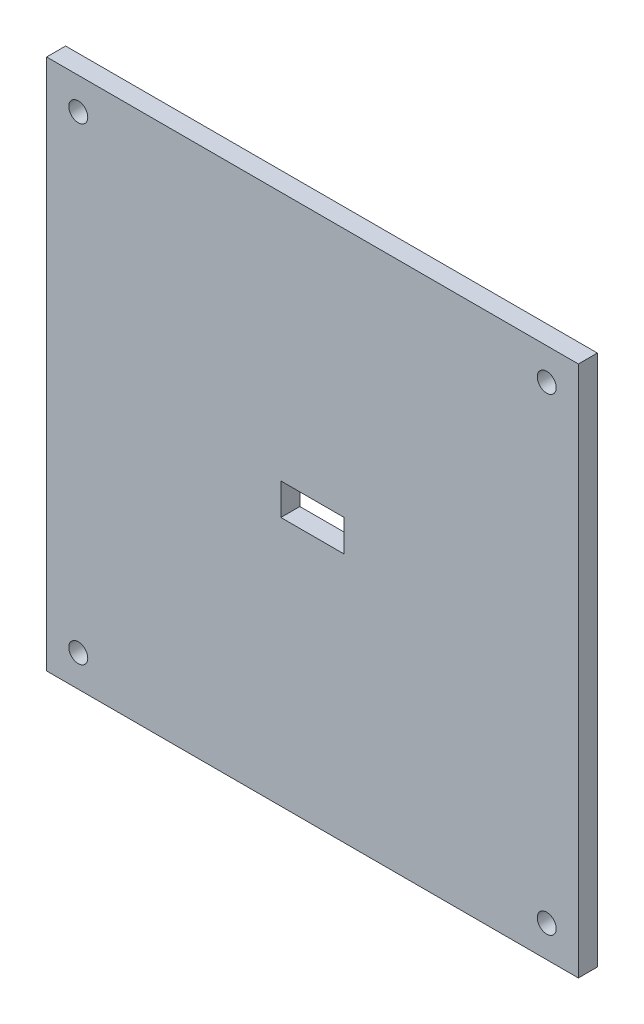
ISO-10303-21;
HEADER;
FILE_DESCRIPTION(('STEP AP214'),'2;1');
FILE_NAME('part.step','',(''),(''),'','','');
FILE_SCHEMA(('AUTOMOTIVE_DESIGN { 1 0 10303 214 1 1 1 1 }'));
ENDSEC;
DATA;
#1=APPLICATION_CONTEXT('core data for automotive mechanical design processes');
#2=APPLICATION_PROTOCOL_DEFINITION('international standard','automotive_design',2000,#1);
#3=PRODUCT_CONTEXT('',#1,'mechanical');
#4=PRODUCT('Part','Part','',(#3));
#5=PRODUCT_RELATED_PRODUCT_CATEGORY('part','',(#4));
#6=PRODUCT_DEFINITION_FORMATION('','',#4);
#7=PRODUCT_DEFINITION_CONTEXT('part definition',#1,'design');
#8=PRODUCT_DEFINITION('design','',#6,#7);
#9=PRODUCT_DEFINITION_SHAPE('','',#8);
#10=(LENGTH_UNIT() NAMED_UNIT(*) SI_UNIT(.MILLI.,.METRE.));
#11=(NAMED_UNIT(*) PLANE_ANGLE_UNIT() SI_UNIT($,.RADIAN.));
#12=(NAMED_UNIT(*) SI_UNIT($,.STERADIAN.) SOLID_ANGLE_UNIT());
#13=UNCERTAINTY_MEASURE_WITH_UNIT(LENGTH_MEASURE(1.E-05),#10,'distance_accuracy_value','');
#14=(GEOMETRIC_REPRESENTATION_CONTEXT(3) GLOBAL_UNCERTAINTY_ASSIGNED_CONTEXT((#13)) GLOBAL_UNIT_ASSIGNED_CONTEXT((#10,
#11,#12)) REPRESENTATION_CONTEXT('',''));
#15=CARTESIAN_POINT('',(0.,0.,0.));
#16=DIRECTION('',(0.,0.,1.));
#17=DIRECTION('',(1.,0.,0.));
#18=AXIS2_PLACEMENT_3D('',#15,#16,#17);
#19=CARTESIAN_POINT('',(0.,0.,3.));
#20=DIRECTION('',(0.,0.,1.));
#21=DIRECTION('',(1.,0.,0.));
#22=AXIS2_PLACEMENT_3D('',#19,#20,#21);
#23=PLANE('',#22);
#24=CARTESIAN_POINT('',(37.0000000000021,-36.9999999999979,3.));
#25=DIRECTION('',(0.,0.,1.));
#26=DIRECTION('',(1.,0.,0.));
#27=AXIS2_PLACEMENT_3D('',#24,#25,#26);
#28=CIRCLE('',#27,1.50000000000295);
#29=CARTESIAN_POINT('',(38.500000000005,-36.9999999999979,3.));
#30=VERTEX_POINT('',#29);
#31=EDGE_CURVE('E245',#30,#30,#28,.T.);
#32=ORIENTED_EDGE('',*,*,#31,.F.);
#33=EDGE_LOOP('',(#32));
#34=FACE_BOUND('',#33,.T.);
#35=CARTESIAN_POINT('',(-37.,37.,3.));
#36=DIRECTION('',(0.,0.,1.));
#37=DIRECTION('',(1.,0.,0.));
#38=AXIS2_PLACEMENT_3D('',#35,#36,#37);
#39=CIRCLE('',#38,1.5);
#40=CARTESIAN_POINT('',(-35.5,37.,3.));
#41=VERTEX_POINT('',#40);
#42=EDGE_CURVE('E127',#41,#41,#39,.T.);
#43=ORIENTED_EDGE('',*,*,#42,.F.);
#44=EDGE_LOOP('',(#43));
#45=FACE_BOUND('',#44,.T.);
#46=DIRECTION('',(0.,1.,0.));
#47=VECTOR('',#46,1.);
#48=CARTESIAN_POINT('',(42.,42.,3.));
#49=LINE('',#48,#47);
#50=CARTESIAN_POINT('',(42.,-42.,3.));
#51=VERTEX_POINT('',#50);
#52=CARTESIAN_POINT('',(42.,42.,3.));
#53=VERTEX_POINT('',#52);
#54=EDGE_CURVE('E137',#51,#53,#49,.T.);
#55=ORIENTED_EDGE('',*,*,#54,.T.);
#56=DIRECTION('',(-1.,0.,0.));
#57=VECTOR('',#56,1.);
#58=CARTESIAN_POINT('',(-42.,42.,3.));
#59=LINE('',#58,#57);
#60=CARTESIAN_POINT('',(-42.,42.,3.));
#61=VERTEX_POINT('',#60);
#62=EDGE_CURVE('E140',#53,#61,#59,.T.);
#63=ORIENTED_EDGE('',*,*,#62,.T.);
#64=DIRECTION('',(0.,-1.,0.));
#65=VECTOR('',#64,1.);
#66=CARTESIAN_POINT('',(-42.,42.,3.));
#67=LINE('',#66,#65);
#68=CARTESIAN_POINT('',(-42.,-42.,3.));
#69=VERTEX_POINT('',#68);
#70=EDGE_CURVE('E143',#61,#69,#67,.T.);
#71=ORIENTED_EDGE('',*,*,#70,.T.);
#72=DIRECTION('',(1.,0.,0.));
#73=VECTOR('',#72,1.);
#74=CARTESIAN_POINT('',(-42.,-42.,3.));
#75=LINE('',#74,#73);
#76=EDGE_CURVE('E145',#69,#51,#75,.T.);
#77=ORIENTED_EDGE('',*,*,#76,.T.);
#78=EDGE_LOOP('',(#55,#63,#71,#77));
#79=FACE_BOUND('',#78,.T.);
#80=DIRECTION('',(-1.,0.,0.));
#81=VECTOR('',#80,1.);
#82=CARTESIAN_POINT('',(-5.,2.50000000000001,3.));
#83=LINE('',#82,#81);
#84=CARTESIAN_POINT('',(5.,2.50000000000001,3.));
#85=VERTEX_POINT('',#84);
#86=CARTESIAN_POINT('',(-5.,2.50000000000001,3.));
#87=VERTEX_POINT('',#86);
#88=EDGE_CURVE('E106',#85,#87,#83,.T.);
#89=ORIENTED_EDGE('',*,*,#88,.F.);
#90=DIRECTION('',(0.,1.,0.));
#91=VECTOR('',#90,1.);
#92=CARTESIAN_POINT('',(5.,2.50000000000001,3.));
#93=LINE('',#92,#91);
#94=CARTESIAN_POINT('',(5.,-2.49999999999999,3.));
#95=VERTEX_POINT('',#94);
#96=EDGE_CURVE('E98',#95,#85,#93,.T.);
#97=ORIENTED_EDGE('',*,*,#96,.F.);
#98=DIRECTION('',(1.,0.,0.));
#99=VECTOR('',#98,1.);
#100=CARTESIAN_POINT('',(-5.,-2.49999999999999,3.));
#101=LINE('',#100,#99);
#102=CARTESIAN_POINT('',(-5.,-2.49999999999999,3.));
#103=VERTEX_POINT('',#102);
#104=EDGE_CURVE('E121',#103,#95,#101,.T.);
#105=ORIENTED_EDGE('',*,*,#104,.F.);
#106=DIRECTION('',(0.,-1.,0.));
#107=VECTOR('',#106,1.);
#108=CARTESIAN_POINT('',(-5.,2.50000000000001,3.));
#109=LINE('',#108,#107);
#110=EDGE_CURVE('E119',#87,#103,#109,.T.);
#111=ORIENTED_EDGE('',*,*,#110,.F.);
#112=EDGE_LOOP('',(#89,#97,#105,#111));
#113=FACE_BOUND('',#112,.T.);
#114=CARTESIAN_POINT('',(37.,37.0000000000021,3.));
#115=DIRECTION('',(0.,0.,1.));
#116=DIRECTION('',(1.,0.,0.));
#117=AXIS2_PLACEMENT_3D('',#114,#115,#116);
#118=CIRCLE('',#117,1.50000000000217);
#119=CARTESIAN_POINT('',(38.5000000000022,37.0000000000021,3.));
#120=VERTEX_POINT('',#119);
#121=EDGE_CURVE('E251',#120,#120,#118,.T.);
#122=ORIENTED_EDGE('',*,*,#121,.F.);
#123=EDGE_LOOP('',(#122));
#124=FACE_BOUND('',#123,.T.);
#125=CARTESIAN_POINT('',(-36.9999999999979,-37.,3.));
#126=DIRECTION('',(0.,0.,1.));
#127=DIRECTION('',(1.,0.,0.));
#128=AXIS2_PLACEMENT_3D('',#125,#126,#127);
#129=CIRCLE('',#128,1.5000000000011);
#130=CARTESIAN_POINT('',(-35.4999999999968,-37.,3.));
#131=VERTEX_POINT('',#130);
#132=EDGE_CURVE('E236',#131,#131,#129,.T.);
#133=ORIENTED_EDGE('',*,*,#132,.F.);
#134=EDGE_LOOP('',(#133));
#135=FACE_BOUND('',#134,.T.);
#136=ADVANCED_FACE('F33',(#34,#45,#79,#113,#124,#135),#23,.T.);
#137=CARTESIAN_POINT('',(0.,0.,0.));
#138=DIRECTION('',(0.,0.,1.));
#139=DIRECTION('',(1.,0.,0.));
#140=AXIS2_PLACEMENT_3D('',#137,#138,#139);
#141=PLANE('',#140);
#142=DIRECTION('',(0.,1.,0.));
#143=VECTOR('',#142,1.);
#144=CARTESIAN_POINT('',(42.,42.,0.));
#145=LINE('',#144,#143);
#146=CARTESIAN_POINT('',(42.,-42.,0.));
#147=VERTEX_POINT('',#146);
#148=CARTESIAN_POINT('',(42.,42.,0.));
#149=VERTEX_POINT('',#148);
#150=EDGE_CURVE('E114',#147,#149,#145,.T.);
#151=ORIENTED_EDGE('',*,*,#150,.F.);
#152=DIRECTION('',(1.,0.,0.));
#153=VECTOR('',#152,1.);
#154=CARTESIAN_POINT('',(-42.,-42.,0.));
#155=LINE('',#154,#153);
#156=CARTESIAN_POINT('',(-42.,-42.,0.));
#157=VERTEX_POINT('',#156);
#158=EDGE_CURVE('E141',#157,#147,#155,.T.);
#159=ORIENTED_EDGE('',*,*,#158,.F.);
#160=DIRECTION('',(0.,-1.,0.));
#161=VECTOR('',#160,1.);
#162=CARTESIAN_POINT('',(-42.,42.,0.));
#163=LINE('',#162,#161);
#164=CARTESIAN_POINT('',(-42.,42.,0.));
#165=VERTEX_POINT('',#164);
#166=EDGE_CURVE('E152',#165,#157,#163,.T.);
#167=ORIENTED_EDGE('',*,*,#166,.F.);
#168=DIRECTION('',(-1.,0.,0.));
#169=VECTOR('',#168,1.);
#170=CARTESIAN_POINT('',(-42.,42.,0.));
#171=LINE('',#170,#169);
#172=EDGE_CURVE('E150',#149,#165,#171,.T.);
#173=ORIENTED_EDGE('',*,*,#172,.F.);
#174=EDGE_LOOP('',(#151,#159,#167,#173));
#175=FACE_BOUND('',#174,.T.);
#176=DIRECTION('',(0.,1.,0.));
#177=VECTOR('',#176,1.);
#178=CARTESIAN_POINT('',(5.,2.50000000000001,0.));
#179=LINE('',#178,#177);
#180=CARTESIAN_POINT('',(5.,-2.49999999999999,0.));
#181=VERTEX_POINT('',#180);
#182=CARTESIAN_POINT('',(5.,2.50000000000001,0.));
#183=VERTEX_POINT('',#182);
#184=EDGE_CURVE('E56',#181,#183,#179,.T.);
#185=ORIENTED_EDGE('',*,*,#184,.T.);
#186=DIRECTION('',(-1.,0.,0.));
#187=VECTOR('',#186,1.);
#188=CARTESIAN_POINT('',(-5.,2.50000000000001,0.));
#189=LINE('',#188,#187);
#190=CARTESIAN_POINT('',(-5.,2.50000000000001,0.));
#191=VERTEX_POINT('',#190);
#192=EDGE_CURVE('E113',#183,#191,#189,.T.);
#193=ORIENTED_EDGE('',*,*,#192,.T.);
#194=DIRECTION('',(0.,-1.,0.));
#195=VECTOR('',#194,1.);
#196=CARTESIAN_POINT('',(-5.,2.50000000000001,0.));
#197=LINE('',#196,#195);
#198=CARTESIAN_POINT('',(-5.,-2.49999999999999,0.));
#199=VERTEX_POINT('',#198);
#200=EDGE_CURVE('E129',#191,#199,#197,.T.);
#201=ORIENTED_EDGE('',*,*,#200,.T.);
#202=DIRECTION('',(1.,0.,0.));
#203=VECTOR('',#202,1.);
#204=CARTESIAN_POINT('',(-5.,-2.49999999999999,0.));
#205=LINE('',#204,#203);
#206=EDGE_CURVE('E107',#199,#181,#205,.T.);
#207=ORIENTED_EDGE('',*,*,#206,.T.);
#208=EDGE_LOOP('',(#185,#193,#201,#207));
#209=FACE_BOUND('',#208,.T.);
#210=CARTESIAN_POINT('',(-37.,37.,0.));
#211=DIRECTION('',(0.,0.,1.));
#212=DIRECTION('',(1.,0.,0.));
#213=AXIS2_PLACEMENT_3D('',#210,#211,#212);
#214=CIRCLE('',#213,1.5);
#215=CARTESIAN_POINT('',(-35.5,37.,0.));
#216=VERTEX_POINT('',#215);
#217=EDGE_CURVE('E254',#216,#216,#214,.T.);
#218=ORIENTED_EDGE('',*,*,#217,.T.);
#219=EDGE_LOOP('',(#218));
#220=FACE_BOUND('',#219,.T.);
#221=CARTESIAN_POINT('',(37.,37.0000000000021,0.));
#222=DIRECTION('',(0.,0.,1.));
#223=DIRECTION('',(1.,0.,0.));
#224=AXIS2_PLACEMENT_3D('',#221,#222,#223);
#225=CIRCLE('',#224,1.50000000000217);
#226=CARTESIAN_POINT('',(38.5000000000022,37.0000000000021,0.));
#227=VERTEX_POINT('',#226);
#228=EDGE_CURVE('E248',#227,#227,#225,.T.);
#229=ORIENTED_EDGE('',*,*,#228,.T.);
#230=EDGE_LOOP('',(#229));
#231=FACE_BOUND('',#230,.T.);
#232=CARTESIAN_POINT('',(37.0000000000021,-36.9999999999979,0.));
#233=DIRECTION('',(0.,0.,1.));
#234=DIRECTION('',(1.,0.,0.));
#235=AXIS2_PLACEMENT_3D('',#232,#233,#234);
#236=CIRCLE('',#235,1.50000000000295);
#237=CARTESIAN_POINT('',(38.500000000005,-36.9999999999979,0.));
#238=VERTEX_POINT('',#237);
#239=EDGE_CURVE('E242',#238,#238,#236,.T.);
#240=ORIENTED_EDGE('',*,*,#239,.T.);
#241=EDGE_LOOP('',(#240));
#242=FACE_BOUND('',#241,.T.);
#243=CARTESIAN_POINT('',(-36.9999999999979,-37.,0.));
#244=DIRECTION('',(0.,0.,1.));
#245=DIRECTION('',(1.,0.,0.));
#246=AXIS2_PLACEMENT_3D('',#243,#244,#245);
#247=CIRCLE('',#246,1.5000000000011);
#248=CARTESIAN_POINT('',(-35.4999999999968,-37.,0.));
#249=VERTEX_POINT('',#248);
#250=EDGE_CURVE('E239',#249,#249,#247,.T.);
#251=ORIENTED_EDGE('',*,*,#250,.T.);
#252=EDGE_LOOP('',(#251));
#253=FACE_BOUND('',#252,.T.);
#254=ADVANCED_FACE('F170',(#175,#209,#220,#231,#242,#253),#141,.F.);
#255=CARTESIAN_POINT('',(42.,42.,3.));
#256=DIRECTION('',(-1.,0.,0.));
#257=DIRECTION('',(0.,-1.,0.));
#258=AXIS2_PLACEMENT_3D('',#255,#256,#257);
#259=PLANE('',#258);
#260=ORIENTED_EDGE('',*,*,#150,.T.);
#261=DIRECTION('',(0.,0.,-1.));
#262=VECTOR('',#261,1.);
#263=CARTESIAN_POINT('',(42.,42.,3.));
#264=LINE('',#263,#262);
#265=EDGE_CURVE('E11',#53,#149,#264,.T.);
#266=ORIENTED_EDGE('',*,*,#265,.F.);
#267=ORIENTED_EDGE('',*,*,#54,.F.);
#268=DIRECTION('',(0.,0.,-1.));
#269=VECTOR('',#268,1.);
#270=CARTESIAN_POINT('',(42.,-42.,3.));
#271=LINE('',#270,#269);
#272=EDGE_CURVE('E147',#51,#147,#271,.T.);
#273=ORIENTED_EDGE('',*,*,#272,.T.);
#274=EDGE_LOOP('',(#260,#266,#267,#273));
#275=FACE_BOUND('',#274,.T.);
#276=ADVANCED_FACE('F35',(#275),#259,.F.);
#277=CARTESIAN_POINT('',(-42.,42.,3.));
#278=DIRECTION('',(0.,-1.,0.));
#279=DIRECTION('',(0.,0.,-1.));
#280=AXIS2_PLACEMENT_3D('',#277,#278,#279);
#281=PLANE('',#280);
#282=ORIENTED_EDGE('',*,*,#172,.T.);
#283=DIRECTION('',(0.,0.,-1.));
#284=VECTOR('',#283,1.);
#285=CARTESIAN_POINT('',(-42.,42.,3.));
#286=LINE('',#285,#284);
#287=EDGE_CURVE('E41',#61,#165,#286,.T.);
#288=ORIENTED_EDGE('',*,*,#287,.F.);
#289=ORIENTED_EDGE('',*,*,#62,.F.);
#290=ORIENTED_EDGE('',*,*,#265,.T.);
#291=EDGE_LOOP('',(#282,#288,#289,#290));
#292=FACE_BOUND('',#291,.T.);
#293=ADVANCED_FACE('F180',(#292),#281,.F.);
#294=CARTESIAN_POINT('',(-42.,42.,3.));
#295=DIRECTION('',(1.,0.,0.));
#296=DIRECTION('',(0.,1.,0.));
#297=AXIS2_PLACEMENT_3D('',#294,#295,#296);
#298=PLANE('',#297);
#299=ORIENTED_EDGE('',*,*,#166,.T.);
#300=DIRECTION('',(0.,0.,-1.));
#301=VECTOR('',#300,1.);
#302=CARTESIAN_POINT('',(-42.,-42.,3.));
#303=LINE('',#302,#301);
#304=EDGE_CURVE('E157',#69,#157,#303,.T.);
#305=ORIENTED_EDGE('',*,*,#304,.F.);
#306=ORIENTED_EDGE('',*,*,#70,.F.);
#307=ORIENTED_EDGE('',*,*,#287,.T.);
#308=EDGE_LOOP('',(#299,#305,#306,#307));
#309=FACE_BOUND('',#308,.T.);
#310=ADVANCED_FACE('F164',(#309),#298,.F.);
#311=CARTESIAN_POINT('',(-42.,-42.,3.));
#312=DIRECTION('',(0.,1.,0.));
#313=DIRECTION('',(0.,0.,1.));
#314=AXIS2_PLACEMENT_3D('',#311,#312,#313);
#315=PLANE('',#314);
#316=ORIENTED_EDGE('',*,*,#158,.T.);
#317=ORIENTED_EDGE('',*,*,#272,.F.);
#318=ORIENTED_EDGE('',*,*,#76,.F.);
#319=ORIENTED_EDGE('',*,*,#304,.T.);
#320=EDGE_LOOP('',(#316,#317,#318,#319));
#321=FACE_BOUND('',#320,.T.);
#322=ADVANCED_FACE('F174',(#321),#315,.F.);
#323=CARTESIAN_POINT('',(5.,2.50000000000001,3.));
#324=DIRECTION('',(-1.,0.,0.));
#325=DIRECTION('',(0.,0.,1.));
#326=AXIS2_PLACEMENT_3D('',#323,#324,#325);
#327=PLANE('',#326);
#328=ORIENTED_EDGE('',*,*,#184,.F.);
#329=DIRECTION('',(0.,0.,-1.));
#330=VECTOR('',#329,1.);
#331=CARTESIAN_POINT('',(5.,-2.49999999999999,3.));
#332=LINE('',#331,#330);
#333=EDGE_CURVE('E102',#95,#181,#332,.T.);
#334=ORIENTED_EDGE('',*,*,#333,.F.);
#335=ORIENTED_EDGE('',*,*,#96,.T.);
#336=DIRECTION('',(0.,0.,-1.));
#337=VECTOR('',#336,1.);
#338=CARTESIAN_POINT('',(5.,2.50000000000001,3.));
#339=LINE('',#338,#337);
#340=EDGE_CURVE('E101',#85,#183,#339,.T.);
#341=ORIENTED_EDGE('',*,*,#340,.T.);
#342=EDGE_LOOP('',(#328,#334,#335,#341));
#343=FACE_BOUND('',#342,.T.);
#344=ADVANCED_FACE('F100',(#343),#327,.T.);
#345=CARTESIAN_POINT('',(-5.,2.50000000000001,3.));
#346=DIRECTION('',(0.,-1.,0.));
#347=DIRECTION('',(0.,0.,-1.));
#348=AXIS2_PLACEMENT_3D('',#345,#346,#347);
#349=PLANE('',#348);
#350=ORIENTED_EDGE('',*,*,#192,.F.);
#351=ORIENTED_EDGE('',*,*,#340,.F.);
#352=ORIENTED_EDGE('',*,*,#88,.T.);
#353=DIRECTION('',(0.,0.,-1.));
#354=VECTOR('',#353,1.);
#355=CARTESIAN_POINT('',(-5.,2.50000000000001,3.));
#356=LINE('',#355,#354);
#357=EDGE_CURVE('E115',#87,#191,#356,.T.);
#358=ORIENTED_EDGE('',*,*,#357,.T.);
#359=EDGE_LOOP('',(#350,#351,#352,#358));
#360=FACE_BOUND('',#359,.T.);
#361=ADVANCED_FACE('F110',(#360),#349,.T.);
#362=CARTESIAN_POINT('',(-5.,2.50000000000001,3.));
#363=DIRECTION('',(1.,0.,0.));
#364=DIRECTION('',(0.,1.,0.));
#365=AXIS2_PLACEMENT_3D('',#362,#363,#364);
#366=PLANE('',#365);
#367=ORIENTED_EDGE('',*,*,#200,.F.);
#368=ORIENTED_EDGE('',*,*,#357,.F.);
#369=ORIENTED_EDGE('',*,*,#110,.T.);
#370=DIRECTION('',(0.,0.,-1.));
#371=VECTOR('',#370,1.);
#372=CARTESIAN_POINT('',(-5.,-2.49999999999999,3.));
#373=LINE('',#372,#371);
#374=EDGE_CURVE('E48',#103,#199,#373,.T.);
#375=ORIENTED_EDGE('',*,*,#374,.T.);
#376=EDGE_LOOP('',(#367,#368,#369,#375));
#377=FACE_BOUND('',#376,.T.);
#378=ADVANCED_FACE('F206',(#377),#366,.T.);
#379=CARTESIAN_POINT('',(-5.,-2.49999999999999,3.));
#380=DIRECTION('',(0.,1.,0.));
#381=DIRECTION('',(0.,0.,1.));
#382=AXIS2_PLACEMENT_3D('',#379,#380,#381);
#383=PLANE('',#382);
#384=ORIENTED_EDGE('',*,*,#206,.F.);
#385=ORIENTED_EDGE('',*,*,#374,.F.);
#386=ORIENTED_EDGE('',*,*,#104,.T.);
#387=ORIENTED_EDGE('',*,*,#333,.T.);
#388=EDGE_LOOP('',(#384,#385,#386,#387));
#389=FACE_BOUND('',#388,.T.);
#390=ADVANCED_FACE('F210',(#389),#383,.T.);
#391=CARTESIAN_POINT('',(-37.,37.,3.));
#392=DIRECTION('',(0.,0.,-1.));
#393=DIRECTION('',(-1.,0.,0.));
#394=AXIS2_PLACEMENT_3D('',#391,#392,#393);
#395=CYLINDRICAL_SURFACE('',#394,1.5);
#396=ORIENTED_EDGE('',*,*,#42,.T.);
#397=EDGE_LOOP('',(#396));
#398=FACE_BOUND('',#397,.T.);
#399=ORIENTED_EDGE('',*,*,#217,.F.);
#400=EDGE_LOOP('',(#399));
#401=FACE_BOUND('',#400,.T.);
#402=ADVANCED_FACE('F216',(#398,#401),#395,.F.);
#403=CARTESIAN_POINT('',(37.,37.0000000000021,3.));
#404=DIRECTION('',(0.,0.,-1.));
#405=DIRECTION('',(-1.,0.,0.));
#406=AXIS2_PLACEMENT_3D('',#403,#404,#405);
#407=CYLINDRICAL_SURFACE('',#406,1.50000000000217);
#408=ORIENTED_EDGE('',*,*,#121,.T.);
#409=EDGE_LOOP('',(#408));
#410=FACE_BOUND('',#409,.T.);
#411=ORIENTED_EDGE('',*,*,#228,.F.);
#412=EDGE_LOOP('',(#411));
#413=FACE_BOUND('',#412,.T.);
#414=ADVANCED_FACE('F219',(#410,#413),#407,.F.);
#415=CARTESIAN_POINT('',(37.0000000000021,-36.9999999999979,3.));
#416=DIRECTION('',(0.,0.,-1.));
#417=DIRECTION('',(-1.,0.,0.));
#418=AXIS2_PLACEMENT_3D('',#415,#416,#417);
#419=CYLINDRICAL_SURFACE('',#418,1.50000000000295);
#420=ORIENTED_EDGE('',*,*,#31,.T.);
#421=EDGE_LOOP('',(#420));
#422=FACE_BOUND('',#421,.T.);
#423=ORIENTED_EDGE('',*,*,#239,.F.);
#424=EDGE_LOOP('',(#423));
#425=FACE_BOUND('',#424,.T.);
#426=ADVANCED_FACE('F223',(#422,#425),#419,.F.);
#427=CARTESIAN_POINT('',(-36.9999999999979,-37.,3.));
#428=DIRECTION('',(0.,0.,-1.));
#429=DIRECTION('',(-1.,0.,0.));
#430=AXIS2_PLACEMENT_3D('',#427,#428,#429);
#431=CYLINDRICAL_SURFACE('',#430,1.5000000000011);
#432=ORIENTED_EDGE('',*,*,#132,.T.);
#433=EDGE_LOOP('',(#432));
#434=FACE_BOUND('',#433,.T.);
#435=ORIENTED_EDGE('',*,*,#250,.F.);
#436=EDGE_LOOP('',(#435));
#437=FACE_BOUND('',#436,.T.);
#438=ADVANCED_FACE('F227',(#434,#437),#431,.F.);
#439=CLOSED_SHELL('',(#136,#254,#276,#293,#310,#322,#344,#361,#378,#390,#402,#414,#426,#438));
#440=MANIFOLD_SOLID_BREP('B2',#439);
#441=ADVANCED_BREP_SHAPE_REPRESENTATION('',(#18,#440),#14);
#442=SHAPE_DEFINITION_REPRESENTATION(#9,#441);
ENDSEC;
END-ISO-10303-21;
